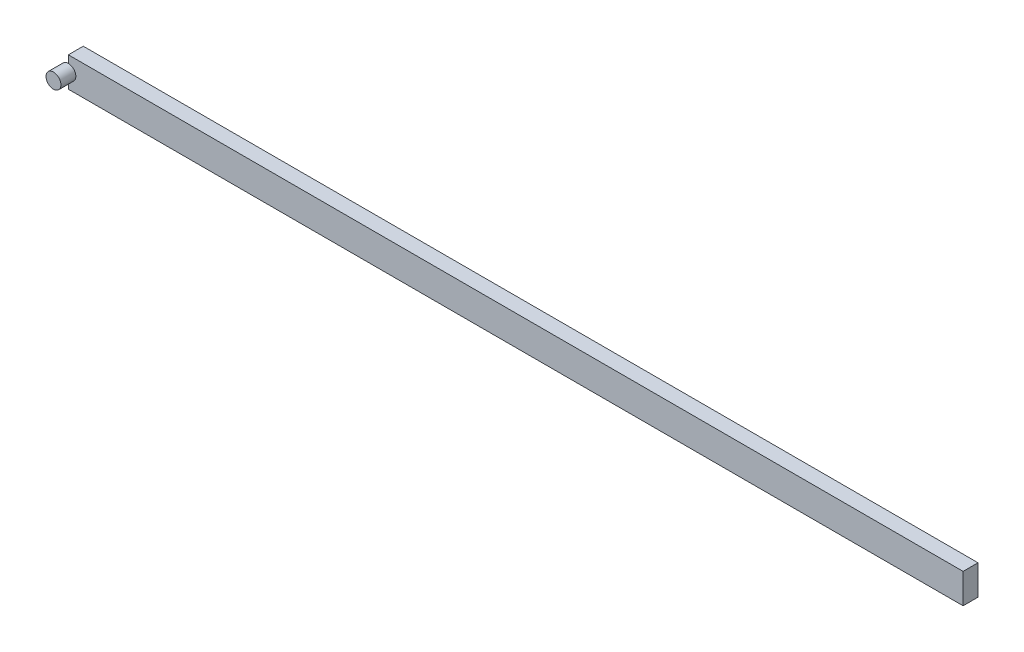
ISO-10303-21;
HEADER;
FILE_DESCRIPTION(('STEP AP214'),'2;1');
FILE_NAME('part.step','',(''),(''),'','','');
FILE_SCHEMA(('AUTOMOTIVE_DESIGN { 1 0 10303 214 1 1 1 1 }'));
ENDSEC;
DATA;
#1=APPLICATION_CONTEXT('core data for automotive mechanical design processes');
#2=APPLICATION_PROTOCOL_DEFINITION('international standard','automotive_design',2000,#1);
#3=PRODUCT_CONTEXT('',#1,'mechanical');
#4=PRODUCT('Part','Part','',(#3));
#5=PRODUCT_RELATED_PRODUCT_CATEGORY('part','',(#4));
#6=PRODUCT_DEFINITION_FORMATION('','',#4);
#7=PRODUCT_DEFINITION_CONTEXT('part definition',#1,'design');
#8=PRODUCT_DEFINITION('design','',#6,#7);
#9=PRODUCT_DEFINITION_SHAPE('','',#8);
#10=(LENGTH_UNIT() NAMED_UNIT(*) SI_UNIT(.MILLI.,.METRE.));
#11=(NAMED_UNIT(*) PLANE_ANGLE_UNIT() SI_UNIT($,.RADIAN.));
#12=(NAMED_UNIT(*) SI_UNIT($,.STERADIAN.) SOLID_ANGLE_UNIT());
#13=UNCERTAINTY_MEASURE_WITH_UNIT(LENGTH_MEASURE(1.E-05),#10,'distance_accuracy_value','');
#14=(GEOMETRIC_REPRESENTATION_CONTEXT(3) GLOBAL_UNCERTAINTY_ASSIGNED_CONTEXT((#13)) GLOBAL_UNIT_ASSIGNED_CONTEXT((#10,
#11,#12)) REPRESENTATION_CONTEXT('',''));
#15=CARTESIAN_POINT('',(0.,0.,0.));
#16=DIRECTION('',(0.,0.,1.));
#17=DIRECTION('',(1.,0.,0.));
#18=AXIS2_PLACEMENT_3D('',#15,#16,#17);
#19=CARTESIAN_POINT('',(600.,20.,-10.));
#20=DIRECTION('',(1.,0.,0.));
#21=DIRECTION('',(0.,0.,-1.));
#22=AXIS2_PLACEMENT_3D('',#19,#20,#21);
#23=PLANE('',#22);
#24=DIRECTION('',(0.,0.,1.));
#25=VECTOR('',#24,1.);
#26=CARTESIAN_POINT('',(600.,20.,-10.));
#27=LINE('',#26,#25);
#28=CARTESIAN_POINT('',(600.,20.,-10.));
#29=VERTEX_POINT('',#28);
#30=CARTESIAN_POINT('',(600.,20.,10.));
#31=VERTEX_POINT('',#30);
#32=EDGE_CURVE('E35',#29,#31,#27,.T.);
#33=ORIENTED_EDGE('',*,*,#32,.T.);
#34=DIRECTION('',(0.,1.,0.));
#35=VECTOR('',#34,1.);
#36=CARTESIAN_POINT('',(600.,20.,10.));
#37=LINE('',#36,#35);
#38=CARTESIAN_POINT('',(600.,-20.,10.));
#39=VERTEX_POINT('',#38);
#40=EDGE_CURVE('E100',#39,#31,#37,.T.);
#41=ORIENTED_EDGE('',*,*,#40,.F.);
#42=DIRECTION('',(0.,0.,1.));
#43=VECTOR('',#42,1.);
#44=CARTESIAN_POINT('',(600.,-20.,-10.));
#45=LINE('',#44,#43);
#46=CARTESIAN_POINT('',(600.,-20.,-10.));
#47=VERTEX_POINT('',#46);
#48=EDGE_CURVE('E40',#47,#39,#45,.T.);
#49=ORIENTED_EDGE('',*,*,#48,.F.);
#50=DIRECTION('',(0.,1.,0.));
#51=VECTOR('',#50,1.);
#52=CARTESIAN_POINT('',(600.,20.,-10.));
#53=LINE('',#52,#51);
#54=EDGE_CURVE('E107',#47,#29,#53,.T.);
#55=ORIENTED_EDGE('',*,*,#54,.T.);
#56=EDGE_LOOP('',(#33,#41,#49,#55));
#57=FACE_BOUND('',#56,.T.);
#58=ADVANCED_FACE('F32',(#57),#23,.T.);
#59=CARTESIAN_POINT('',(-600.,-20.,-10.));
#60=DIRECTION('',(0.,-1.,0.));
#61=DIRECTION('',(0.,0.,-1.));
#62=AXIS2_PLACEMENT_3D('',#59,#60,#61);
#63=PLANE('',#62);
#64=ORIENTED_EDGE('',*,*,#48,.T.);
#65=DIRECTION('',(1.,0.,0.));
#66=VECTOR('',#65,1.);
#67=CARTESIAN_POINT('',(-600.,-20.,10.));
#68=LINE('',#67,#66);
#69=CARTESIAN_POINT('',(-600.,-20.,10.));
#70=VERTEX_POINT('',#69);
#71=EDGE_CURVE('E85',#70,#39,#68,.T.);
#72=ORIENTED_EDGE('',*,*,#71,.F.);
#73=DIRECTION('',(0.,0.,1.));
#74=VECTOR('',#73,1.);
#75=CARTESIAN_POINT('',(-600.,-20.,-10.));
#76=LINE('',#75,#74);
#77=CARTESIAN_POINT('',(-600.,-20.,-10.));
#78=VERTEX_POINT('',#77);
#79=EDGE_CURVE('E119',#78,#70,#76,.T.);
#80=ORIENTED_EDGE('',*,*,#79,.F.);
#81=DIRECTION('',(1.,0.,0.));
#82=VECTOR('',#81,1.);
#83=CARTESIAN_POINT('',(-600.,-20.,-10.));
#84=LINE('',#83,#82);
#85=EDGE_CURVE('E115',#78,#47,#84,.T.);
#86=ORIENTED_EDGE('',*,*,#85,.T.);
#87=EDGE_LOOP('',(#64,#72,#80,#86));
#88=FACE_BOUND('',#87,.T.);
#89=ADVANCED_FACE('F126',(#88),#63,.T.);
#90=CARTESIAN_POINT('',(-600.,20.,-10.));
#91=DIRECTION('',(-1.,0.,0.));
#92=DIRECTION('',(0.,0.,1.));
#93=AXIS2_PLACEMENT_3D('',#90,#91,#92);
#94=PLANE('',#93);
#95=ORIENTED_EDGE('',*,*,#79,.T.);
#96=DIRECTION('',(0.,-1.,0.));
#97=VECTOR('',#96,1.);
#98=CARTESIAN_POINT('',(-600.,20.,10.));
#99=LINE('',#98,#97);
#100=CARTESIAN_POINT('',(-600.,-9.99999999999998,10.));
#101=VERTEX_POINT('',#100);
#102=EDGE_CURVE('E88',#101,#70,#99,.T.);
#103=ORIENTED_EDGE('',*,*,#102,.F.);
#104=CARTESIAN_POINT('',(-600.,9.99999999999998,10.));
#105=VERTEX_POINT('',#104);
#106=EDGE_CURVE('E86',#105,#101,#99,.T.);
#107=ORIENTED_EDGE('',*,*,#106,.F.);
#108=CARTESIAN_POINT('',(-600.,20.,10.));
#109=VERTEX_POINT('',#108);
#110=EDGE_CURVE('E78',#109,#105,#99,.T.);
#111=ORIENTED_EDGE('',*,*,#110,.F.);
#112=DIRECTION('',(0.,0.,1.));
#113=VECTOR('',#112,1.);
#114=CARTESIAN_POINT('',(-600.,20.,-10.));
#115=LINE('',#114,#113);
#116=CARTESIAN_POINT('',(-600.,20.,-10.));
#117=VERTEX_POINT('',#116);
#118=EDGE_CURVE('E120',#117,#109,#115,.T.);
#119=ORIENTED_EDGE('',*,*,#118,.F.);
#120=DIRECTION('',(0.,-1.,0.));
#121=VECTOR('',#120,1.);
#122=CARTESIAN_POINT('',(-600.,20.,-10.));
#123=LINE('',#122,#121);
#124=EDGE_CURVE('E112',#117,#78,#123,.T.);
#125=ORIENTED_EDGE('',*,*,#124,.T.);
#126=EDGE_LOOP('',(#95,#103,#107,#111,#119,#125));
#127=FACE_BOUND('',#126,.T.);
#128=ADVANCED_FACE('F91',(#127),#94,.T.);
#129=CARTESIAN_POINT('',(-600.,20.,-10.));
#130=DIRECTION('',(0.,1.,0.));
#131=DIRECTION('',(0.,0.,1.));
#132=AXIS2_PLACEMENT_3D('',#129,#130,#131);
#133=PLANE('',#132);
#134=ORIENTED_EDGE('',*,*,#118,.T.);
#135=DIRECTION('',(-1.,0.,0.));
#136=VECTOR('',#135,1.);
#137=CARTESIAN_POINT('',(-600.,20.,10.));
#138=LINE('',#137,#136);
#139=EDGE_CURVE('E83',#31,#109,#138,.T.);
#140=ORIENTED_EDGE('',*,*,#139,.F.);
#141=ORIENTED_EDGE('',*,*,#32,.F.);
#142=DIRECTION('',(-1.,0.,0.));
#143=VECTOR('',#142,1.);
#144=CARTESIAN_POINT('',(-600.,20.,-10.));
#145=LINE('',#144,#143);
#146=EDGE_CURVE('E109',#29,#117,#145,.T.);
#147=ORIENTED_EDGE('',*,*,#146,.T.);
#148=EDGE_LOOP('',(#134,#140,#141,#147));
#149=FACE_BOUND('',#148,.T.);
#150=ADVANCED_FACE('F123',(#149),#133,.T.);
#151=CARTESIAN_POINT('',(0.,0.,-10.));
#152=DIRECTION('',(0.,0.,1.));
#153=DIRECTION('',(1.,0.,0.));
#154=AXIS2_PLACEMENT_3D('',#151,#152,#153);
#155=PLANE('',#154);
#156=ORIENTED_EDGE('',*,*,#54,.F.);
#157=ORIENTED_EDGE('',*,*,#85,.F.);
#158=ORIENTED_EDGE('',*,*,#124,.F.);
#159=ORIENTED_EDGE('',*,*,#146,.F.);
#160=EDGE_LOOP('',(#156,#157,#158,#159));
#161=FACE_BOUND('',#160,.T.);
#162=ADVANCED_FACE('F130',(#161),#155,.F.);
#163=CARTESIAN_POINT('',(0.,0.,10.));
#164=DIRECTION('',(0.,0.,1.));
#165=DIRECTION('',(1.,0.,0.));
#166=AXIS2_PLACEMENT_3D('',#163,#164,#165);
#167=PLANE('',#166);
#168=CARTESIAN_POINT('',(-600.,0.,10.));
#169=DIRECTION('',(0.,0.,1.));
#170=DIRECTION('',(1.,0.,0.));
#171=AXIS2_PLACEMENT_3D('',#168,#169,#170);
#172=CIRCLE('',#171,9.99999999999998);
#173=EDGE_CURVE('E11',#101,#105,#172,.T.);
#174=ORIENTED_EDGE('',*,*,#173,.F.);
#175=ORIENTED_EDGE('',*,*,#102,.T.);
#176=ORIENTED_EDGE('',*,*,#71,.T.);
#177=ORIENTED_EDGE('',*,*,#40,.T.);
#178=ORIENTED_EDGE('',*,*,#139,.T.);
#179=ORIENTED_EDGE('',*,*,#110,.T.);
#180=EDGE_LOOP('',(#174,#175,#176,#177,#178,#179));
#181=FACE_BOUND('',#180,.T.);
#182=ADVANCED_FACE('F80',(#181),#167,.T.);
#183=CARTESIAN_POINT('',(-600.,0.,10.));
#184=DIRECTION('',(0.,0.,1.));
#185=DIRECTION('',(1.,0.,0.));
#186=AXIS2_PLACEMENT_3D('',#183,#184,#185);
#187=PLANE('',#186);
#188=EDGE_CURVE('E42',#105,#101,#172,.T.);
#189=ORIENTED_EDGE('',*,*,#188,.F.);
#190=ORIENTED_EDGE('',*,*,#106,.T.);
#191=EDGE_LOOP('',(#189,#190));
#192=FACE_BOUND('',#191,.T.);
#193=ADVANCED_FACE('F97',(#192),#187,.F.);
#194=CARTESIAN_POINT('',(-600.,0.,30.));
#195=DIRECTION('',(0.,0.,-1.));
#196=DIRECTION('',(-1.,0.,0.));
#197=AXIS2_PLACEMENT_3D('',#194,#195,#196);
#198=CYLINDRICAL_SURFACE('',#197,9.99999999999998);
#199=CARTESIAN_POINT('',(-600.,0.,30.));
#200=DIRECTION('',(0.,0.,1.));
#201=DIRECTION('',(1.,0.,0.));
#202=AXIS2_PLACEMENT_3D('',#199,#200,#201);
#203=CIRCLE('',#202,9.99999999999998);
#204=CARTESIAN_POINT('',(-590.,0.,30.));
#205=VERTEX_POINT('',#204);
#206=EDGE_CURVE('E98',#205,#205,#203,.T.);
#207=ORIENTED_EDGE('',*,*,#206,.F.);
#208=EDGE_LOOP('',(#207));
#209=FACE_BOUND('',#208,.T.);
#210=ORIENTED_EDGE('',*,*,#188,.T.);
#211=ORIENTED_EDGE('',*,*,#173,.T.);
#212=EDGE_LOOP('',(#210,#211));
#213=FACE_BOUND('',#212,.T.);
#214=ADVANCED_FACE('F96',(#209,#213),#198,.T.);
#215=CARTESIAN_POINT('',(-600.,0.,30.));
#216=DIRECTION('',(0.,0.,1.));
#217=DIRECTION('',(1.,0.,0.));
#218=AXIS2_PLACEMENT_3D('',#215,#216,#217);
#219=PLANE('',#218);
#220=ORIENTED_EDGE('',*,*,#206,.T.);
#221=EDGE_LOOP('',(#220));
#222=FACE_BOUND('',#221,.T.);
#223=ADVANCED_FACE('F181',(#222),#219,.T.);
#224=CLOSED_SHELL('',(#58,#89,#128,#150,#162,#182,#193,#214,#223));
#225=MANIFOLD_SOLID_BREP('B2',#224);
#226=ADVANCED_BREP_SHAPE_REPRESENTATION('',(#18,#225),#14);
#227=SHAPE_DEFINITION_REPRESENTATION(#9,#226);
ENDSEC;
END-ISO-10303-21;
